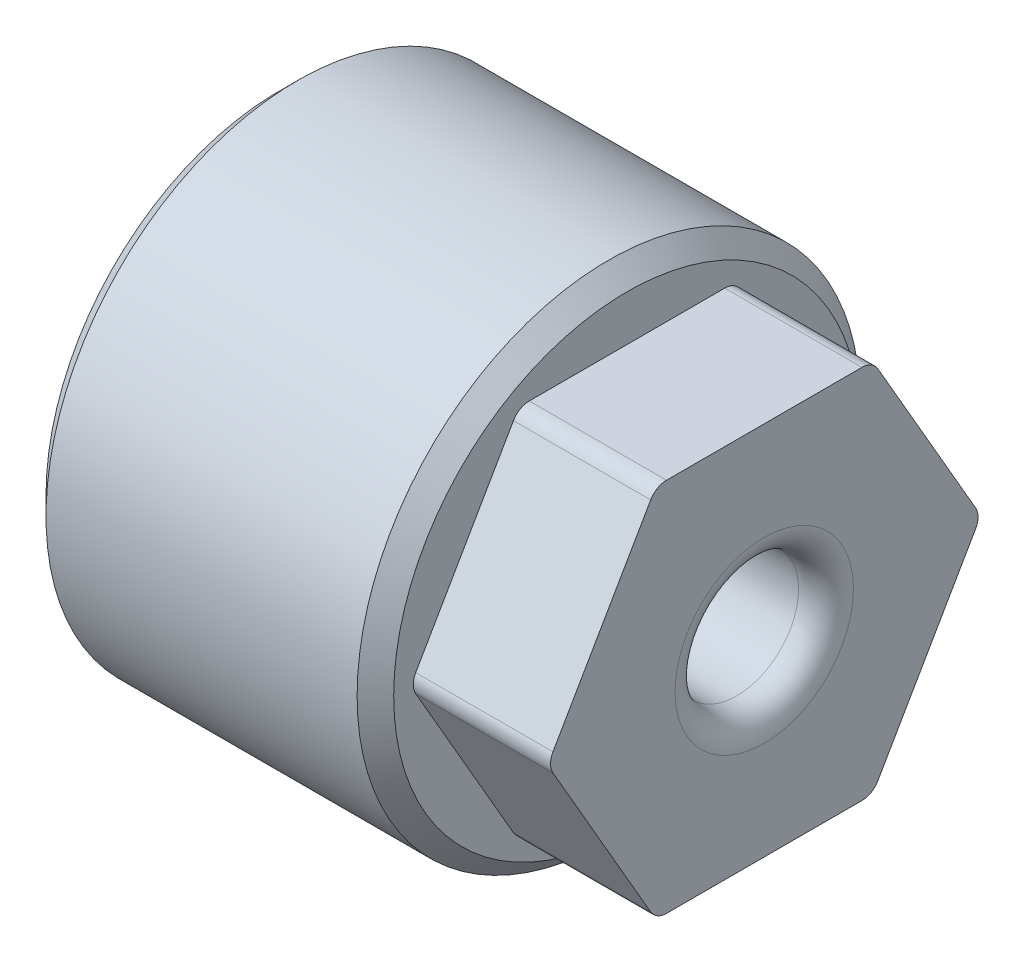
ISO-10303-21;
HEADER;
FILE_DESCRIPTION(('STEP AP214'),'2;1');
FILE_NAME('part.step','',(''),(''),'','','');
FILE_SCHEMA(('AUTOMOTIVE_DESIGN { 1 0 10303 214 1 1 1 1 }'));
ENDSEC;
DATA;
#1=APPLICATION_CONTEXT('core data for automotive mechanical design processes');
#2=APPLICATION_PROTOCOL_DEFINITION('international standard','automotive_design',2000,#1);
#3=PRODUCT_CONTEXT('',#1,'mechanical');
#4=PRODUCT('Part','Part','',(#3));
#5=PRODUCT_RELATED_PRODUCT_CATEGORY('part','',(#4));
#6=PRODUCT_DEFINITION_FORMATION('','',#4);
#7=PRODUCT_DEFINITION_CONTEXT('part definition',#1,'design');
#8=PRODUCT_DEFINITION('design','',#6,#7);
#9=PRODUCT_DEFINITION_SHAPE('','',#8);
#10=(LENGTH_UNIT() NAMED_UNIT(*) SI_UNIT(.MILLI.,.METRE.));
#11=(NAMED_UNIT(*) PLANE_ANGLE_UNIT() SI_UNIT($,.RADIAN.));
#12=(NAMED_UNIT(*) SI_UNIT($,.STERADIAN.) SOLID_ANGLE_UNIT());
#13=UNCERTAINTY_MEASURE_WITH_UNIT(LENGTH_MEASURE(1.E-05),#10,'distance_accuracy_value','');
#14=(GEOMETRIC_REPRESENTATION_CONTEXT(3) GLOBAL_UNCERTAINTY_ASSIGNED_CONTEXT((#13)) GLOBAL_UNIT_ASSIGNED_CONTEXT((#10,
#11,#12)) REPRESENTATION_CONTEXT('',''));
#15=CARTESIAN_POINT('',(0.,0.,0.));
#16=DIRECTION('',(0.,0.,1.));
#17=DIRECTION('',(1.,0.,0.));
#18=AXIS2_PLACEMENT_3D('',#15,#16,#17);
#19=CARTESIAN_POINT('',(27.,0.,0.));
#20=DIRECTION('',(1.,0.,0.));
#21=DIRECTION('',(0.,0.,-1.));
#22=AXIS2_PLACEMENT_3D('',#19,#20,#21);
#23=CYLINDRICAL_SURFACE('',#22,6.75);
#24=CARTESIAN_POINT('',(50.,0.,0.));
#25=DIRECTION('',(1.,0.,0.));
#26=DIRECTION('',(0.,0.,-1.));
#27=AXIS2_PLACEMENT_3D('',#24,#25,#26);
#28=CIRCLE('',#27,6.75);
#29=CARTESIAN_POINT('',(50.,0.,-6.75));
#30=VERTEX_POINT('',#29);
#31=EDGE_CURVE('E173',#30,#30,#28,.F.);
#32=ORIENTED_EDGE('',*,*,#31,.F.);
#33=EDGE_LOOP('',(#32));
#34=FACE_BOUND('',#33,.T.);
#35=CARTESIAN_POINT('',(1.,0.,0.));
#36=DIRECTION('',(1.,0.,0.));
#37=DIRECTION('',(0.,0.,-1.));
#38=AXIS2_PLACEMENT_3D('',#35,#36,#37);
#39=CIRCLE('',#38,6.75);
#40=CARTESIAN_POINT('',(1.,0.,-6.75));
#41=VERTEX_POINT('',#40);
#42=EDGE_CURVE('E19',#41,#41,#39,.T.);
#43=ORIENTED_EDGE('',*,*,#42,.F.);
#44=EDGE_LOOP('',(#43));
#45=FACE_BOUND('',#44,.T.);
#46=ADVANCED_FACE('F16',(#34,#45),#23,.F.);
#47=CARTESIAN_POINT('',(50.,0.,0.));
#48=DIRECTION('',(1.,0.,0.));
#49=DIRECTION('',(0.,0.,-1.));
#50=AXIS2_PLACEMENT_3D('',#47,#48,#49);
#51=TOROIDAL_SURFACE('',#50,9.75,3.);
#52=ORIENTED_EDGE('',*,*,#31,.T.);
#53=EDGE_LOOP('',(#52));
#54=FACE_BOUND('',#53,.T.);
#55=CARTESIAN_POINT('',(53.,0.,0.));
#56=DIRECTION('',(1.,0.,0.));
#57=DIRECTION('',(0.,1.,0.));
#58=AXIS2_PLACEMENT_3D('',#55,#56,#57);
#59=CIRCLE('',#58,9.75);
#60=CARTESIAN_POINT('',(53.,9.75,0.));
#61=VERTEX_POINT('',#60);
#62=EDGE_CURVE('E143',#61,#61,#59,.F.);
#63=ORIENTED_EDGE('',*,*,#62,.F.);
#64=EDGE_LOOP('',(#63));
#65=FACE_BOUND('',#64,.T.);
#66=ADVANCED_FACE('F163',(#54,#65),#51,.T.);
#67=CARTESIAN_POINT('',(1.,12.5,0.));
#68=DIRECTION('',(-1.,0.,0.));
#69=DIRECTION('',(0.,0.,1.));
#70=AXIS2_PLACEMENT_3D('',#67,#68,#69);
#71=PLANE('',#70);
#72=CARTESIAN_POINT('',(1.,0.,0.));
#73=DIRECTION('',(1.,0.,0.));
#74=DIRECTION('',(0.,0.,-1.));
#75=AXIS2_PLACEMENT_3D('',#72,#73,#74);
#76=CIRCLE('',#75,12.5);
#77=CARTESIAN_POINT('',(1.,0.,-12.5));
#78=VERTEX_POINT('',#77);
#79=EDGE_CURVE('E138',#78,#78,#76,.F.);
#80=ORIENTED_EDGE('',*,*,#79,.T.);
#81=EDGE_LOOP('',(#80));
#82=FACE_BOUND('',#81,.T.);
#83=ORIENTED_EDGE('',*,*,#42,.T.);
#84=EDGE_LOOP('',(#83));
#85=FACE_BOUND('',#84,.T.);
#86=ADVANCED_FACE('F160',(#82,#85),#71,.T.);
#87=CARTESIAN_POINT('',(53.,6.74999999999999,0.));
#88=DIRECTION('',(1.,0.,0.));
#89=DIRECTION('',(0.,0.,-1.));
#90=AXIS2_PLACEMENT_3D('',#87,#88,#89);
#91=PLANE('',#90);
#92=ORIENTED_EDGE('',*,*,#62,.T.);
#93=EDGE_LOOP('',(#92));
#94=FACE_BOUND('',#93,.T.);
#95=CARTESIAN_POINT('',(53.,-18.5,-10.6809799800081));
#96=DIRECTION('',(-1.,0.,0.));
#97=DIRECTION('',(0.,0.,1.));
#98=AXIS2_PLACEMENT_3D('',#95,#96,#97);
#99=CIRCLE('',#98,2.);
#100=CARTESIAN_POINT('',(53.,-19.5,-12.413030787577));
#101=VERTEX_POINT('',#100);
#102=CARTESIAN_POINT('',(53.,-20.5,-10.6809799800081));
#103=VERTEX_POINT('',#102);
#104=EDGE_CURVE('E103',#101,#103,#99,.T.);
#105=ORIENTED_EDGE('',*,*,#104,.F.);
#106=DIRECTION('',(0.,0.866025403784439,-0.5));
#107=VECTOR('',#106,1.);
#108=CARTESIAN_POINT('',(53.,0.,-23.6713610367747));
#109=LINE('',#108,#107);
#110=CARTESIAN_POINT('',(53.,-1.00000000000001,-23.0940107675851));
#111=VERTEX_POINT('',#110);
#112=EDGE_CURVE('E113',#111,#101,#109,.F.);
#113=ORIENTED_EDGE('',*,*,#112,.F.);
#114=CARTESIAN_POINT('',(53.,0.,-21.3619599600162));
#115=DIRECTION('',(-1.,0.,0.));
#116=DIRECTION('',(0.,0.,1.));
#117=AXIS2_PLACEMENT_3D('',#114,#115,#116);
#118=CIRCLE('',#117,2.);
#119=CARTESIAN_POINT('',(53.,1.00000000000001,-23.0940107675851));
#120=VERTEX_POINT('',#119);
#121=EDGE_CURVE('E135',#120,#111,#118,.T.);
#122=ORIENTED_EDGE('',*,*,#121,.F.);
#123=DIRECTION('',(0.,0.866025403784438,0.500000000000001));
#124=VECTOR('',#123,1.);
#125=CARTESIAN_POINT('',(53.,20.5,-11.8356805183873));
#126=LINE('',#125,#124);
#127=CARTESIAN_POINT('',(53.,19.5,-12.4130307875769));
#128=VERTEX_POINT('',#127);
#129=EDGE_CURVE('E133',#128,#120,#126,.F.);
#130=ORIENTED_EDGE('',*,*,#129,.F.);
#131=CARTESIAN_POINT('',(53.,18.5,-10.6809799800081));
#132=DIRECTION('',(-1.,0.,0.));
#133=DIRECTION('',(0.,0.,1.));
#134=AXIS2_PLACEMENT_3D('',#131,#132,#133);
#135=CIRCLE('',#134,2.);
#136=CARTESIAN_POINT('',(53.,20.5,-10.6809799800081));
#137=VERTEX_POINT('',#136);
#138=EDGE_CURVE('E221',#137,#128,#135,.T.);
#139=ORIENTED_EDGE('',*,*,#138,.F.);
#140=DIRECTION('',(0.,0.,1.));
#141=VECTOR('',#140,1.);
#142=CARTESIAN_POINT('',(53.,20.5,11.8356805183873));
#143=LINE('',#142,#141);
#144=CARTESIAN_POINT('',(53.,20.5,10.6809799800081));
#145=VERTEX_POINT('',#144);
#146=EDGE_CURVE('E148',#145,#137,#143,.F.);
#147=ORIENTED_EDGE('',*,*,#146,.F.);
#148=CARTESIAN_POINT('',(53.,18.5,10.6809799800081));
#149=DIRECTION('',(-1.,0.,0.));
#150=DIRECTION('',(0.,0.,1.));
#151=AXIS2_PLACEMENT_3D('',#148,#149,#150);
#152=CIRCLE('',#151,2.);
#153=CARTESIAN_POINT('',(53.,19.5,12.413030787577));
#154=VERTEX_POINT('',#153);
#155=EDGE_CURVE('E224',#154,#145,#152,.T.);
#156=ORIENTED_EDGE('',*,*,#155,.F.);
#157=DIRECTION('',(0.,-0.866025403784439,0.499999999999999));
#158=VECTOR('',#157,1.);
#159=CARTESIAN_POINT('',(53.,0.,23.6713610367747));
#160=LINE('',#159,#158);
#161=CARTESIAN_POINT('',(53.,0.999999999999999,23.0940107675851));
#162=VERTEX_POINT('',#161);
#163=EDGE_CURVE('E227',#162,#154,#160,.F.);
#164=ORIENTED_EDGE('',*,*,#163,.F.);
#165=CARTESIAN_POINT('',(53.,0.,21.3619599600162));
#166=DIRECTION('',(-1.,0.,0.));
#167=DIRECTION('',(0.,0.,1.));
#168=AXIS2_PLACEMENT_3D('',#165,#166,#167);
#169=CIRCLE('',#168,2.);
#170=CARTESIAN_POINT('',(53.,-1.00000000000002,23.094010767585));
#171=VERTEX_POINT('',#170);
#172=EDGE_CURVE('E228',#171,#162,#169,.T.);
#173=ORIENTED_EDGE('',*,*,#172,.F.);
#174=DIRECTION('',(0.,-0.866025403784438,-0.5));
#175=VECTOR('',#174,1.);
#176=CARTESIAN_POINT('',(53.,-20.5,11.8356805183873));
#177=LINE('',#176,#175);
#178=CARTESIAN_POINT('',(53.,-19.5,12.4130307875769));
#179=VERTEX_POINT('',#178);
#180=EDGE_CURVE('E231',#179,#171,#177,.F.);
#181=ORIENTED_EDGE('',*,*,#180,.F.);
#182=CARTESIAN_POINT('',(53.,-18.5,10.6809799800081));
#183=DIRECTION('',(-1.,0.,0.));
#184=DIRECTION('',(0.,0.,1.));
#185=AXIS2_PLACEMENT_3D('',#182,#183,#184);
#186=CIRCLE('',#185,2.);
#187=CARTESIAN_POINT('',(53.,-20.5,10.6809799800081));
#188=VERTEX_POINT('',#187);
#189=EDGE_CURVE('E119',#188,#179,#186,.T.);
#190=ORIENTED_EDGE('',*,*,#189,.F.);
#191=DIRECTION('',(0.,0.,-1.));
#192=VECTOR('',#191,1.);
#193=CARTESIAN_POINT('',(53.,-20.5,-11.8356805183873));
#194=LINE('',#193,#192);
#195=EDGE_CURVE('E116',#103,#188,#194,.F.);
#196=ORIENTED_EDGE('',*,*,#195,.F.);
#197=EDGE_LOOP('',(#105,#113,#122,#130,#139,#147,#156,#164,#173,#181,#190,#196));
#198=FACE_BOUND('',#197,.T.);
#199=ADVANCED_FACE('F117',(#94,#198),#91,.T.);
#200=CARTESIAN_POINT('',(0.5,0.,0.));
#201=DIRECTION('',(1.,0.,0.));
#202=DIRECTION('',(0.,0.,-1.));
#203=AXIS2_PLACEMENT_3D('',#200,#201,#202);
#204=CYLINDRICAL_SURFACE('',#203,12.5);
#205=CARTESIAN_POINT('',(0.,0.,0.));
#206=DIRECTION('',(1.,0.,0.));
#207=DIRECTION('',(0.,0.,-1.));
#208=AXIS2_PLACEMENT_3D('',#205,#206,#207);
#209=CIRCLE('',#208,12.5);
#210=CARTESIAN_POINT('',(0.,0.,-12.5));
#211=VERTEX_POINT('',#210);
#212=EDGE_CURVE('E215',#211,#211,#209,.T.);
#213=ORIENTED_EDGE('',*,*,#212,.F.);
#214=EDGE_LOOP('',(#213));
#215=FACE_BOUND('',#214,.T.);
#216=ORIENTED_EDGE('',*,*,#79,.F.);
#217=EDGE_LOOP('',(#216));
#218=FACE_BOUND('',#217,.T.);
#219=ADVANCED_FACE('F159',(#215,#218),#204,.F.);
#220=CARTESIAN_POINT('',(53.,0.,-23.6713610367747));
#221=DIRECTION('',(0.,-0.5,-0.866025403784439));
#222=DIRECTION('',(0.,0.866025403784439,-0.5));
#223=AXIS2_PLACEMENT_3D('',#220,#221,#222);
#224=PLANE('',#223);
#225=DIRECTION('',(-1.,0.,0.));
#226=VECTOR('',#225,1.);
#227=CARTESIAN_POINT('',(53.,-19.5,-12.413030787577));
#228=LINE('',#227,#226);
#229=CARTESIAN_POINT('',(38.,-19.5,-12.413030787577));
#230=VERTEX_POINT('',#229);
#231=EDGE_CURVE('E112',#230,#101,#228,.F.);
#232=ORIENTED_EDGE('',*,*,#231,.F.);
#233=DIRECTION('',(0.,-0.86602540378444,0.499999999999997));
#234=VECTOR('',#233,1.);
#235=CARTESIAN_POINT('',(38.,-0.999999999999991,-23.094010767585));
#236=LINE('',#235,#234);
#237=CARTESIAN_POINT('',(38.,-0.999999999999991,-23.094010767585));
#238=VERTEX_POINT('',#237);
#239=EDGE_CURVE('E214',#238,#230,#236,.T.);
#240=ORIENTED_EDGE('',*,*,#239,.F.);
#241=DIRECTION('',(-1.,0.,0.));
#242=VECTOR('',#241,1.);
#243=CARTESIAN_POINT('',(53.,-1.00000000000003,-23.0940107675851));
#244=LINE('',#243,#242);
#245=EDGE_CURVE('E220',#111,#238,#244,.T.);
#246=ORIENTED_EDGE('',*,*,#245,.F.);
#247=ORIENTED_EDGE('',*,*,#112,.T.);
#248=EDGE_LOOP('',(#232,#240,#246,#247));
#249=FACE_BOUND('',#248,.T.);
#250=ADVANCED_FACE('F306',(#249),#224,.T.);
#251=CARTESIAN_POINT('',(53.,-18.5,-10.6809799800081));
#252=DIRECTION('',(-1.,0.,0.));
#253=DIRECTION('',(0.,0.,1.));
#254=AXIS2_PLACEMENT_3D('',#251,#252,#253);
#255=CYLINDRICAL_SURFACE('',#254,2.);
#256=CARTESIAN_POINT('',(38.,-18.5,-10.6809799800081));
#257=DIRECTION('',(-1.,0.,0.));
#258=DIRECTION('',(0.,0.,1.));
#259=AXIS2_PLACEMENT_3D('',#256,#257,#258);
#260=CIRCLE('',#259,2.);
#261=CARTESIAN_POINT('',(38.,-20.5,-10.6809799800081));
#262=VERTEX_POINT('',#261);
#263=EDGE_CURVE('E212',#230,#262,#260,.T.);
#264=ORIENTED_EDGE('',*,*,#263,.F.);
#265=ORIENTED_EDGE('',*,*,#231,.T.);
#266=ORIENTED_EDGE('',*,*,#104,.T.);
#267=DIRECTION('',(1.,0.,0.));
#268=VECTOR('',#267,1.);
#269=CARTESIAN_POINT('',(53.,-20.5,-10.6809799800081));
#270=LINE('',#269,#268);
#271=EDGE_CURVE('E110',#262,#103,#270,.T.);
#272=ORIENTED_EDGE('',*,*,#271,.F.);
#273=EDGE_LOOP('',(#264,#265,#266,#272));
#274=FACE_BOUND('',#273,.T.);
#275=ADVANCED_FACE('F108',(#274),#255,.T.);
#276=CARTESIAN_POINT('',(53.,-20.5,-11.8356805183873));
#277=DIRECTION('',(0.,-1.,0.));
#278=DIRECTION('',(0.,0.,-1.));
#279=AXIS2_PLACEMENT_3D('',#276,#277,#278);
#280=PLANE('',#279);
#281=DIRECTION('',(-1.,0.,0.));
#282=VECTOR('',#281,1.);
#283=CARTESIAN_POINT('',(53.,-20.5,10.6809799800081));
#284=LINE('',#283,#282);
#285=CARTESIAN_POINT('',(38.,-20.5,10.6809799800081));
#286=VERTEX_POINT('',#285);
#287=EDGE_CURVE('E130',#286,#188,#284,.F.);
#288=ORIENTED_EDGE('',*,*,#287,.F.);
#289=DIRECTION('',(0.,0.,-1.));
#290=VECTOR('',#289,1.);
#291=CARTESIAN_POINT('',(38.,-20.5,0.));
#292=LINE('',#291,#290);
#293=EDGE_CURVE('E125',#262,#286,#292,.F.);
#294=ORIENTED_EDGE('',*,*,#293,.F.);
#295=ORIENTED_EDGE('',*,*,#271,.T.);
#296=ORIENTED_EDGE('',*,*,#195,.T.);
#297=EDGE_LOOP('',(#288,#294,#295,#296));
#298=FACE_BOUND('',#297,.T.);
#299=ADVANCED_FACE('F123',(#298),#280,.T.);
#300=CARTESIAN_POINT('',(53.,-18.5,10.6809799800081));
#301=DIRECTION('',(-1.,0.,0.));
#302=DIRECTION('',(0.,0.,1.));
#303=AXIS2_PLACEMENT_3D('',#300,#301,#302);
#304=CYLINDRICAL_SURFACE('',#303,2.);
#305=CARTESIAN_POINT('',(38.,-18.5,10.6809799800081));
#306=DIRECTION('',(-1.,0.,0.));
#307=DIRECTION('',(0.,0.,1.));
#308=AXIS2_PLACEMENT_3D('',#305,#306,#307);
#309=CIRCLE('',#308,2.);
#310=CARTESIAN_POINT('',(38.,-19.5,12.4130307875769));
#311=VERTEX_POINT('',#310);
#312=EDGE_CURVE('E209',#286,#311,#309,.T.);
#313=ORIENTED_EDGE('',*,*,#312,.F.);
#314=ORIENTED_EDGE('',*,*,#287,.T.);
#315=ORIENTED_EDGE('',*,*,#189,.T.);
#316=DIRECTION('',(1.,0.,0.));
#317=VECTOR('',#316,1.);
#318=CARTESIAN_POINT('',(53.,-19.5,12.4130307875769));
#319=LINE('',#318,#317);
#320=EDGE_CURVE('E337',#311,#179,#319,.T.);
#321=ORIENTED_EDGE('',*,*,#320,.F.);
#322=EDGE_LOOP('',(#313,#314,#315,#321));
#323=FACE_BOUND('',#322,.T.);
#324=ADVANCED_FACE('F298',(#323),#304,.T.);
#325=CARTESIAN_POINT('',(53.,-20.5,11.8356805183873));
#326=DIRECTION('',(0.,-0.5,0.866025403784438));
#327=DIRECTION('',(0.,-0.866025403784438,-0.5));
#328=AXIS2_PLACEMENT_3D('',#325,#326,#327);
#329=PLANE('',#328);
#330=ORIENTED_EDGE('',*,*,#320,.T.);
#331=ORIENTED_EDGE('',*,*,#180,.T.);
#332=DIRECTION('',(-1.,0.,0.));
#333=VECTOR('',#332,1.);
#334=CARTESIAN_POINT('',(53.,-1.00000000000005,23.0940107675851));
#335=LINE('',#334,#333);
#336=CARTESIAN_POINT('',(38.,-1.00000000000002,23.094010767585));
#337=VERTEX_POINT('',#336);
#338=EDGE_CURVE('E230',#337,#171,#335,.F.);
#339=ORIENTED_EDGE('',*,*,#338,.F.);
#340=DIRECTION('',(0.,0.866025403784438,0.500000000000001));
#341=VECTOR('',#340,1.);
#342=CARTESIAN_POINT('',(38.,-19.5,12.4130307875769));
#343=LINE('',#342,#341);
#344=EDGE_CURVE('E208',#311,#337,#343,.T.);
#345=ORIENTED_EDGE('',*,*,#344,.F.);
#346=EDGE_LOOP('',(#330,#331,#339,#345));
#347=FACE_BOUND('',#346,.T.);
#348=ADVANCED_FACE('F294',(#347),#329,.T.);
#349=CARTESIAN_POINT('',(53.,0.,21.3619599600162));
#350=DIRECTION('',(-1.,0.,0.));
#351=DIRECTION('',(0.,0.,1.));
#352=AXIS2_PLACEMENT_3D('',#349,#350,#351);
#353=CYLINDRICAL_SURFACE('',#352,2.);
#354=CARTESIAN_POINT('',(38.,0.,21.3619599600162));
#355=DIRECTION('',(-1.,0.,0.));
#356=DIRECTION('',(0.,0.,1.));
#357=AXIS2_PLACEMENT_3D('',#354,#355,#356);
#358=CIRCLE('',#357,2.);
#359=CARTESIAN_POINT('',(38.,0.99999999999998,23.094010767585));
#360=VERTEX_POINT('',#359);
#361=EDGE_CURVE('E205',#337,#360,#358,.T.);
#362=ORIENTED_EDGE('',*,*,#361,.F.);
#363=ORIENTED_EDGE('',*,*,#338,.T.);
#364=ORIENTED_EDGE('',*,*,#172,.T.);
#365=DIRECTION('',(1.,0.,0.));
#366=VECTOR('',#365,1.);
#367=CARTESIAN_POINT('',(53.,1.00000000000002,23.0940107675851));
#368=LINE('',#367,#366);
#369=EDGE_CURVE('E333',#360,#162,#368,.T.);
#370=ORIENTED_EDGE('',*,*,#369,.F.);
#371=EDGE_LOOP('',(#362,#363,#364,#370));
#372=FACE_BOUND('',#371,.T.);
#373=ADVANCED_FACE('F290',(#372),#353,.T.);
#374=CARTESIAN_POINT('',(53.,0.,23.6713610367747));
#375=DIRECTION('',(0.,0.499999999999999,0.866025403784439));
#376=DIRECTION('',(0.,-0.866025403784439,0.499999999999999));
#377=AXIS2_PLACEMENT_3D('',#374,#375,#376);
#378=PLANE('',#377);
#379=ORIENTED_EDGE('',*,*,#369,.T.);
#380=ORIENTED_EDGE('',*,*,#163,.T.);
#381=DIRECTION('',(-1.,0.,0.));
#382=VECTOR('',#381,1.);
#383=CARTESIAN_POINT('',(53.,19.5,12.413030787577));
#384=LINE('',#383,#382);
#385=CARTESIAN_POINT('',(38.,19.5,12.413030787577));
#386=VERTEX_POINT('',#385);
#387=EDGE_CURVE('E226',#386,#154,#384,.F.);
#388=ORIENTED_EDGE('',*,*,#387,.F.);
#389=DIRECTION('',(0.,0.86602540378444,-0.499999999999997));
#390=VECTOR('',#389,1.);
#391=CARTESIAN_POINT('',(38.,0.999999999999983,23.094010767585));
#392=LINE('',#391,#390);
#393=EDGE_CURVE('E204',#360,#386,#392,.T.);
#394=ORIENTED_EDGE('',*,*,#393,.F.);
#395=EDGE_LOOP('',(#379,#380,#388,#394));
#396=FACE_BOUND('',#395,.T.);
#397=ADVANCED_FACE('F286',(#396),#378,.T.);
#398=CARTESIAN_POINT('',(53.,18.5,10.6809799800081));
#399=DIRECTION('',(-1.,0.,0.));
#400=DIRECTION('',(0.,0.,1.));
#401=AXIS2_PLACEMENT_3D('',#398,#399,#400);
#402=CYLINDRICAL_SURFACE('',#401,2.);
#403=CARTESIAN_POINT('',(38.,18.5,10.6809799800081));
#404=DIRECTION('',(-1.,0.,0.));
#405=DIRECTION('',(0.,0.,1.));
#406=AXIS2_PLACEMENT_3D('',#403,#404,#405);
#407=CIRCLE('',#406,2.);
#408=CARTESIAN_POINT('',(38.,20.5,10.6809799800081));
#409=VERTEX_POINT('',#408);
#410=EDGE_CURVE('E201',#386,#409,#407,.T.);
#411=ORIENTED_EDGE('',*,*,#410,.F.);
#412=ORIENTED_EDGE('',*,*,#387,.T.);
#413=ORIENTED_EDGE('',*,*,#155,.T.);
#414=DIRECTION('',(1.,0.,0.));
#415=VECTOR('',#414,1.);
#416=CARTESIAN_POINT('',(53.,20.5,10.6809799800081));
#417=LINE('',#416,#415);
#418=EDGE_CURVE('E328',#409,#145,#417,.T.);
#419=ORIENTED_EDGE('',*,*,#418,.F.);
#420=EDGE_LOOP('',(#411,#412,#413,#419));
#421=FACE_BOUND('',#420,.T.);
#422=ADVANCED_FACE('F282',(#421),#402,.T.);
#423=CARTESIAN_POINT('',(53.,20.5,11.8356805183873));
#424=DIRECTION('',(0.,1.,0.));
#425=DIRECTION('',(0.,0.,1.));
#426=AXIS2_PLACEMENT_3D('',#423,#424,#425);
#427=PLANE('',#426);
#428=ORIENTED_EDGE('',*,*,#418,.T.);
#429=ORIENTED_EDGE('',*,*,#146,.T.);
#430=DIRECTION('',(-1.,0.,0.));
#431=VECTOR('',#430,1.);
#432=CARTESIAN_POINT('',(53.,20.5,-10.6809799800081));
#433=LINE('',#432,#431);
#434=CARTESIAN_POINT('',(38.,20.5,-10.6809799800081));
#435=VERTEX_POINT('',#434);
#436=EDGE_CURVE('E223',#435,#137,#433,.F.);
#437=ORIENTED_EDGE('',*,*,#436,.F.);
#438=DIRECTION('',(0.,0.,-1.));
#439=VECTOR('',#438,1.);
#440=CARTESIAN_POINT('',(38.,20.5,0.));
#441=LINE('',#440,#439);
#442=EDGE_CURVE('E200',#409,#435,#441,.T.);
#443=ORIENTED_EDGE('',*,*,#442,.F.);
#444=EDGE_LOOP('',(#428,#429,#437,#443));
#445=FACE_BOUND('',#444,.T.);
#446=ADVANCED_FACE('F278',(#445),#427,.T.);
#447=CARTESIAN_POINT('',(53.,18.5,-10.6809799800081));
#448=DIRECTION('',(-1.,0.,0.));
#449=DIRECTION('',(0.,0.,1.));
#450=AXIS2_PLACEMENT_3D('',#447,#448,#449);
#451=CYLINDRICAL_SURFACE('',#450,2.);
#452=CARTESIAN_POINT('',(38.,18.5,-10.6809799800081));
#453=DIRECTION('',(-1.,0.,0.));
#454=DIRECTION('',(0.,0.,1.));
#455=AXIS2_PLACEMENT_3D('',#452,#453,#454);
#456=CIRCLE('',#455,2.);
#457=CARTESIAN_POINT('',(38.,19.5,-12.4130307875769));
#458=VERTEX_POINT('',#457);
#459=EDGE_CURVE('E197',#435,#458,#456,.T.);
#460=ORIENTED_EDGE('',*,*,#459,.F.);
#461=ORIENTED_EDGE('',*,*,#436,.T.);
#462=ORIENTED_EDGE('',*,*,#138,.T.);
#463=DIRECTION('',(1.,0.,0.));
#464=VECTOR('',#463,1.);
#465=CARTESIAN_POINT('',(53.,19.5,-12.4130307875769));
#466=LINE('',#465,#464);
#467=EDGE_CURVE('E136',#458,#128,#466,.T.);
#468=ORIENTED_EDGE('',*,*,#467,.F.);
#469=EDGE_LOOP('',(#460,#461,#462,#468));
#470=FACE_BOUND('',#469,.T.);
#471=ADVANCED_FACE('F275',(#470),#451,.T.);
#472=CARTESIAN_POINT('',(53.,20.5,-11.8356805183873));
#473=DIRECTION('',(0.,0.500000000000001,-0.866025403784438));
#474=DIRECTION('',(0.,0.866025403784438,0.500000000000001));
#475=AXIS2_PLACEMENT_3D('',#472,#473,#474);
#476=PLANE('',#475);
#477=ORIENTED_EDGE('',*,*,#467,.T.);
#478=ORIENTED_EDGE('',*,*,#129,.T.);
#479=DIRECTION('',(-1.,0.,0.));
#480=VECTOR('',#479,1.);
#481=CARTESIAN_POINT('',(53.,1.00000000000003,-23.0940107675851));
#482=LINE('',#481,#480);
#483=CARTESIAN_POINT('',(38.,1.,-23.094010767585));
#484=VERTEX_POINT('',#483);
#485=EDGE_CURVE('E34',#484,#120,#482,.F.);
#486=ORIENTED_EDGE('',*,*,#485,.F.);
#487=DIRECTION('',(0.,-0.866025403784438,-0.500000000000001));
#488=VECTOR('',#487,1.);
#489=CARTESIAN_POINT('',(38.,19.5,-12.4130307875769));
#490=LINE('',#489,#488);
#491=EDGE_CURVE('E196',#458,#484,#490,.T.);
#492=ORIENTED_EDGE('',*,*,#491,.F.);
#493=EDGE_LOOP('',(#477,#478,#486,#492));
#494=FACE_BOUND('',#493,.T.);
#495=ADVANCED_FACE('F271',(#494),#476,.T.);
#496=CARTESIAN_POINT('',(53.,0.,-21.3619599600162));
#497=DIRECTION('',(-1.,0.,0.));
#498=DIRECTION('',(0.,0.,1.));
#499=AXIS2_PLACEMENT_3D('',#496,#497,#498);
#500=CYLINDRICAL_SURFACE('',#499,2.);
#501=CARTESIAN_POINT('',(38.,0.,-21.3619599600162));
#502=DIRECTION('',(-1.,0.,0.));
#503=DIRECTION('',(0.,0.,1.));
#504=AXIS2_PLACEMENT_3D('',#501,#502,#503);
#505=CIRCLE('',#504,2.);
#506=EDGE_CURVE('E193',#484,#238,#505,.T.);
#507=ORIENTED_EDGE('',*,*,#506,.F.);
#508=ORIENTED_EDGE('',*,*,#485,.T.);
#509=ORIENTED_EDGE('',*,*,#121,.T.);
#510=ORIENTED_EDGE('',*,*,#245,.T.);
#511=EDGE_LOOP('',(#507,#508,#509,#510));
#512=FACE_BOUND('',#511,.T.);
#513=ADVANCED_FACE('F267',(#512),#500,.T.);
#514=CARTESIAN_POINT('',(0.,27.5,0.));
#515=DIRECTION('',(-1.,0.,0.));
#516=DIRECTION('',(0.,0.,1.));
#517=AXIS2_PLACEMENT_3D('',#514,#515,#516);
#518=PLANE('',#517);
#519=CARTESIAN_POINT('',(2.55264559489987E-12,0.,0.));
#520=DIRECTION('',(1.,0.,0.));
#521=DIRECTION('',(0.,0.,-1.));
#522=AXIS2_PLACEMENT_3D('',#519,#520,#521);
#523=CIRCLE('',#522,25.4999999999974);
#524=CARTESIAN_POINT('',(2.55264559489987E-12,0.,-25.4999999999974));
#525=VERTEX_POINT('',#524);
#526=EDGE_CURVE('E190',#525,#525,#523,.T.);
#527=ORIENTED_EDGE('',*,*,#526,.F.);
#528=EDGE_LOOP('',(#527));
#529=FACE_BOUND('',#528,.T.);
#530=ORIENTED_EDGE('',*,*,#212,.T.);
#531=EDGE_LOOP('',(#530));
#532=FACE_BOUND('',#531,.T.);
#533=ADVANCED_FACE('F263',(#529,#532),#518,.T.);
#534=CARTESIAN_POINT('',(38.,0.,0.));
#535=DIRECTION('',(1.,0.,0.));
#536=DIRECTION('',(0.,0.,-1.));
#537=AXIS2_PLACEMENT_3D('',#534,#535,#536);
#538=PLANE('',#537);
#539=ORIENTED_EDGE('',*,*,#491,.T.);
#540=ORIENTED_EDGE('',*,*,#506,.T.);
#541=ORIENTED_EDGE('',*,*,#239,.T.);
#542=ORIENTED_EDGE('',*,*,#263,.T.);
#543=ORIENTED_EDGE('',*,*,#293,.T.);
#544=ORIENTED_EDGE('',*,*,#312,.T.);
#545=ORIENTED_EDGE('',*,*,#344,.T.);
#546=ORIENTED_EDGE('',*,*,#361,.T.);
#547=ORIENTED_EDGE('',*,*,#393,.T.);
#548=ORIENTED_EDGE('',*,*,#410,.T.);
#549=ORIENTED_EDGE('',*,*,#442,.T.);
#550=ORIENTED_EDGE('',*,*,#459,.T.);
#551=EDGE_LOOP('',(#539,#540,#541,#542,#543,#544,#545,#546,#547,#548,#549,#550));
#552=FACE_BOUND('',#551,.T.);
#553=CARTESIAN_POINT('',(37.9999999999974,0.,0.));
#554=DIRECTION('',(-1.,0.,0.));
#555=DIRECTION('',(0.,0.,1.));
#556=AXIS2_PLACEMENT_3D('',#553,#554,#555);
#557=CIRCLE('',#556,25.4999999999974);
#558=CARTESIAN_POINT('',(37.9999999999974,0.,25.4999999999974));
#559=VERTEX_POINT('',#558);
#560=EDGE_CURVE('E182',#559,#559,#557,.T.);
#561=ORIENTED_EDGE('',*,*,#560,.F.);
#562=EDGE_LOOP('',(#561));
#563=FACE_BOUND('',#562,.T.);
#564=ADVANCED_FACE('F259',(#552,#563),#538,.T.);
#565=CARTESIAN_POINT('',(1.99999999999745,0.,0.));
#566=DIRECTION('',(1.,0.,0.));
#567=DIRECTION('',(0.,0.,-1.));
#568=AXIS2_PLACEMENT_3D('',#565,#566,#567);
#569=CONICAL_SURFACE('',#568,27.5000000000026,0.7853981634);
#570=CARTESIAN_POINT('',(2.,0.,0.));
#571=DIRECTION('',(1.,0.,0.));
#572=DIRECTION('',(0.,0.,-1.));
#573=AXIS2_PLACEMENT_3D('',#570,#571,#572);
#574=CIRCLE('',#573,27.5);
#575=CARTESIAN_POINT('',(2.,0.,-27.5));
#576=VERTEX_POINT('',#575);
#577=EDGE_CURVE('E25',#576,#576,#574,.T.);
#578=ORIENTED_EDGE('',*,*,#577,.F.);
#579=EDGE_LOOP('',(#578));
#580=FACE_BOUND('',#579,.T.);
#581=ORIENTED_EDGE('',*,*,#526,.T.);
#582=EDGE_LOOP('',(#581));
#583=FACE_BOUND('',#582,.T.);
#584=ADVANCED_FACE('F252',(#580,#583),#569,.T.);
#585=CARTESIAN_POINT('',(36.0000000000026,0.,0.));
#586=DIRECTION('',(-1.,0.,0.));
#587=DIRECTION('',(0.,0.,1.));
#588=AXIS2_PLACEMENT_3D('',#585,#586,#587);
#589=CONICAL_SURFACE('',#588,27.5000000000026,0.7853981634);
#590=ORIENTED_EDGE('',*,*,#560,.T.);
#591=EDGE_LOOP('',(#590));
#592=FACE_BOUND('',#591,.T.);
#593=CARTESIAN_POINT('',(36.,0.,0.));
#594=DIRECTION('',(1.,0.,0.));
#595=DIRECTION('',(0.,0.,-1.));
#596=AXIS2_PLACEMENT_3D('',#593,#594,#595);
#597=CIRCLE('',#596,27.5);
#598=CARTESIAN_POINT('',(36.,0.,-27.5));
#599=VERTEX_POINT('',#598);
#600=EDGE_CURVE('E11',#599,#599,#597,.F.);
#601=ORIENTED_EDGE('',*,*,#600,.F.);
#602=EDGE_LOOP('',(#601));
#603=FACE_BOUND('',#602,.T.);
#604=ADVANCED_FACE('F246',(#592,#603),#589,.T.);
#605=CARTESIAN_POINT('',(19.,0.,0.));
#606=DIRECTION('',(1.,0.,0.));
#607=DIRECTION('',(0.,0.,-1.));
#608=AXIS2_PLACEMENT_3D('',#605,#606,#607);
#609=CYLINDRICAL_SURFACE('',#608,27.5);
#610=ORIENTED_EDGE('',*,*,#600,.T.);
#611=EDGE_LOOP('',(#610));
#612=FACE_BOUND('',#611,.T.);
#613=ORIENTED_EDGE('',*,*,#577,.T.);
#614=EDGE_LOOP('',(#613));
#615=FACE_BOUND('',#614,.T.);
#616=ADVANCED_FACE('F244',(#612,#615),#609,.T.);
#617=CLOSED_SHELL('',(#46,#66,#86,#199,#219,#250,#275,#299,#324,#348,#373,#397,#422,#446,#471,
#495,#513,#533,#564,#584,#604,#616));
#618=MANIFOLD_SOLID_BREP('B1',#617);
#619=ADVANCED_BREP_SHAPE_REPRESENTATION('',(#18,#618),#14);
#620=SHAPE_DEFINITION_REPRESENTATION(#9,#619);
ENDSEC;
END-ISO-10303-21;
